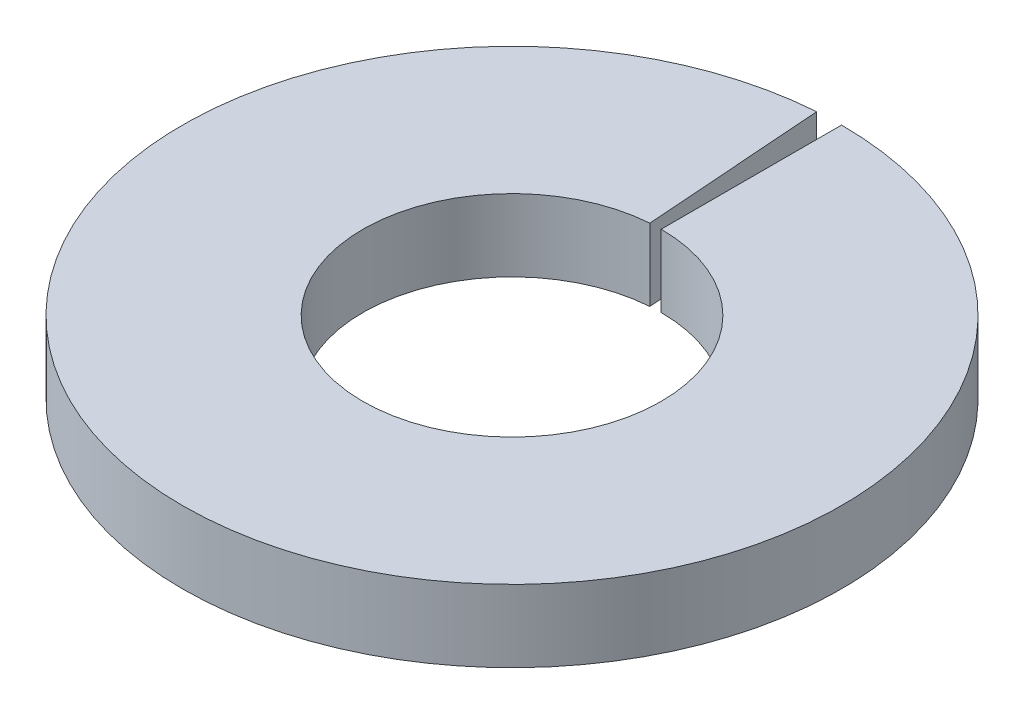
ISO-10303-21;
HEADER;
FILE_DESCRIPTION(('STEP AP214'),'2;1');
FILE_NAME('part.step','',(''),(''),'','','');
FILE_SCHEMA(('AUTOMOTIVE_DESIGN { 1 0 10303 214 1 1 1 1 }'));
ENDSEC;
DATA;
#1=APPLICATION_CONTEXT('core data for automotive mechanical design processes');
#2=APPLICATION_PROTOCOL_DEFINITION('international standard','automotive_design',2000,#1);
#3=PRODUCT_CONTEXT('',#1,'mechanical');
#4=PRODUCT('Part','Part','',(#3));
#5=PRODUCT_RELATED_PRODUCT_CATEGORY('part','',(#4));
#6=PRODUCT_DEFINITION_FORMATION('','',#4);
#7=PRODUCT_DEFINITION_CONTEXT('part definition',#1,'design');
#8=PRODUCT_DEFINITION('design','',#6,#7);
#9=PRODUCT_DEFINITION_SHAPE('','',#8);
#10=(LENGTH_UNIT() NAMED_UNIT(*) SI_UNIT(.MILLI.,.METRE.));
#11=(NAMED_UNIT(*) PLANE_ANGLE_UNIT() SI_UNIT($,.RADIAN.));
#12=(NAMED_UNIT(*) SI_UNIT($,.STERADIAN.) SOLID_ANGLE_UNIT());
#13=UNCERTAINTY_MEASURE_WITH_UNIT(LENGTH_MEASURE(1.E-05),#10,'distance_accuracy_value','');
#14=(GEOMETRIC_REPRESENTATION_CONTEXT(3) GLOBAL_UNCERTAINTY_ASSIGNED_CONTEXT((#13)) GLOBAL_UNIT_ASSIGNED_CONTEXT((#10,
#11,#12)) REPRESENTATION_CONTEXT('',''));
#15=CARTESIAN_POINT('',(0.,0.,0.));
#16=DIRECTION('',(0.,0.,1.));
#17=DIRECTION('',(1.,0.,0.));
#18=AXIS2_PLACEMENT_3D('',#15,#16,#17);
#19=CARTESIAN_POINT('',(0.,0.381,0.));
#20=DIRECTION('',(0.,-1.,0.));
#21=DIRECTION('',(0.,0.,-1.));
#22=AXIS2_PLACEMENT_3D('',#19,#20,#21);
#23=CYLINDRICAL_SURFACE('',#22,0.7874);
#24=CARTESIAN_POINT('',(0.,0.,0.));
#25=DIRECTION('',(0.,-1.,0.));
#26=DIRECTION('',(0.,0.,1.));
#27=AXIS2_PLACEMENT_3D('',#24,#25,#26);
#28=CIRCLE('',#27,0.7874);
#29=CARTESIAN_POINT('',(0.,0.,-0.7874));
#30=VERTEX_POINT('',#29);
#31=CARTESIAN_POINT('',(-0.0574744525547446,0.,-0.78529959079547));
#32=VERTEX_POINT('',#31);
#33=EDGE_CURVE('E97',#30,#32,#28,.T.);
#34=ORIENTED_EDGE('',*,*,#33,.T.);
#35=DIRECTION('',(0.,-1.,0.));
#36=VECTOR('',#35,1.);
#37=CARTESIAN_POINT('',(-0.0574744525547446,0.381,-0.78529959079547));
#38=LINE('',#37,#36);
#39=CARTESIAN_POINT('',(-0.0574744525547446,0.381,-0.78529959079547));
#40=VERTEX_POINT('',#39);
#41=EDGE_CURVE('E11',#40,#32,#38,.T.);
#42=ORIENTED_EDGE('',*,*,#41,.F.);
#43=CARTESIAN_POINT('',(0.,0.381,0.));
#44=DIRECTION('',(0.,-1.,0.));
#45=DIRECTION('',(0.,0.,1.));
#46=AXIS2_PLACEMENT_3D('',#43,#44,#45);
#47=CIRCLE('',#46,0.7874);
#48=CARTESIAN_POINT('',(0.,0.381,-0.7874));
#49=VERTEX_POINT('',#48);
#50=EDGE_CURVE('E85',#49,#40,#47,.T.);
#51=ORIENTED_EDGE('',*,*,#50,.F.);
#52=DIRECTION('',(0.,-1.,0.));
#53=VECTOR('',#52,1.);
#54=CARTESIAN_POINT('',(0.,0.381,-0.7874));
#55=LINE('',#54,#53);
#56=EDGE_CURVE('E93',#49,#30,#55,.T.);
#57=ORIENTED_EDGE('',*,*,#56,.T.);
#58=EDGE_LOOP('',(#34,#42,#51,#57));
#59=FACE_BOUND('',#58,.T.);
#60=ADVANCED_FACE('F34',(#59),#23,.F.);
#61=CARTESIAN_POINT('',(-0.0574744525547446,0.381,-0.78529959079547));
#62=DIRECTION('',(-0.997332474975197,0.,0.072992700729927));
#63=DIRECTION('',(0.072992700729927,0.,0.997332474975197));
#64=AXIS2_PLACEMENT_3D('',#61,#62,#63);
#65=PLANE('',#64);
#66=DIRECTION('',(-0.072992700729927,0.,-0.997332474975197));
#67=VECTOR('',#66,1.);
#68=CARTESIAN_POINT('',(-0.0574744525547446,0.,-0.78529959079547));
#69=LINE('',#68,#67);
#70=CARTESIAN_POINT('',(-0.127,0.,-1.73525877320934));
#71=VERTEX_POINT('',#70);
#72=EDGE_CURVE('E89',#32,#71,#69,.T.);
#73=ORIENTED_EDGE('',*,*,#72,.T.);
#74=DIRECTION('',(0.,-1.,0.));
#75=VECTOR('',#74,1.);
#76=CARTESIAN_POINT('',(-0.127,0.381,-1.73525877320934));
#77=LINE('',#76,#75);
#78=CARTESIAN_POINT('',(-0.127,0.381,-1.73525877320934));
#79=VERTEX_POINT('',#78);
#80=EDGE_CURVE('E42',#79,#71,#77,.T.);
#81=ORIENTED_EDGE('',*,*,#80,.F.);
#82=DIRECTION('',(-0.072992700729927,0.,-0.997332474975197));
#83=VECTOR('',#82,1.);
#84=CARTESIAN_POINT('',(-0.0574744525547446,0.381,-0.78529959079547));
#85=LINE('',#84,#83);
#86=EDGE_CURVE('E80',#40,#79,#85,.T.);
#87=ORIENTED_EDGE('',*,*,#86,.F.);
#88=ORIENTED_EDGE('',*,*,#41,.T.);
#89=EDGE_LOOP('',(#73,#81,#87,#88));
#90=FACE_BOUND('',#89,.T.);
#91=ADVANCED_FACE('F88',(#90),#65,.F.);
#92=CARTESIAN_POINT('',(0.,0.381,0.));
#93=DIRECTION('',(0.,-1.,0.));
#94=DIRECTION('',(0.,0.,-1.));
#95=AXIS2_PLACEMENT_3D('',#92,#93,#94);
#96=CYLINDRICAL_SURFACE('',#95,1.7399);
#97=CARTESIAN_POINT('',(0.,0.,0.));
#98=DIRECTION('',(0.,1.,0.));
#99=DIRECTION('',(0.,0.,1.));
#100=AXIS2_PLACEMENT_3D('',#97,#98,#99);
#101=CIRCLE('',#100,1.7399);
#102=CARTESIAN_POINT('',(0.,0.,-1.7399));
#103=VERTEX_POINT('',#102);
#104=EDGE_CURVE('E67',#71,#103,#101,.T.);
#105=ORIENTED_EDGE('',*,*,#104,.T.);
#106=DIRECTION('',(0.,-1.,0.));
#107=VECTOR('',#106,1.);
#108=CARTESIAN_POINT('',(0.,0.381,-1.7399));
#109=LINE('',#108,#107);
#110=CARTESIAN_POINT('',(0.,0.381,-1.7399));
#111=VERTEX_POINT('',#110);
#112=EDGE_CURVE('E90',#111,#103,#109,.T.);
#113=ORIENTED_EDGE('',*,*,#112,.F.);
#114=CARTESIAN_POINT('',(0.,0.381,0.));
#115=DIRECTION('',(0.,1.,0.));
#116=DIRECTION('',(0.,0.,1.));
#117=AXIS2_PLACEMENT_3D('',#114,#115,#116);
#118=CIRCLE('',#117,1.7399);
#119=EDGE_CURVE('E83',#79,#111,#118,.T.);
#120=ORIENTED_EDGE('',*,*,#119,.F.);
#121=ORIENTED_EDGE('',*,*,#80,.T.);
#122=EDGE_LOOP('',(#105,#113,#120,#121));
#123=FACE_BOUND('',#122,.T.);
#124=ADVANCED_FACE('F91',(#123),#96,.T.);
#125=CARTESIAN_POINT('',(0.,0.381,-0.7874));
#126=DIRECTION('',(1.,0.,0.));
#127=DIRECTION('',(0.,0.,-1.));
#128=AXIS2_PLACEMENT_3D('',#125,#126,#127);
#129=PLANE('',#128);
#130=DIRECTION('',(0.,0.,1.));
#131=VECTOR('',#130,1.);
#132=CARTESIAN_POINT('',(0.,0.,-0.7874));
#133=LINE('',#132,#131);
#134=EDGE_CURVE('E73',#103,#30,#133,.T.);
#135=ORIENTED_EDGE('',*,*,#134,.T.);
#136=ORIENTED_EDGE('',*,*,#56,.F.);
#137=DIRECTION('',(0.,0.,1.));
#138=VECTOR('',#137,1.);
#139=CARTESIAN_POINT('',(0.,0.381,-0.7874));
#140=LINE('',#139,#138);
#141=EDGE_CURVE('E50',#111,#49,#140,.T.);
#142=ORIENTED_EDGE('',*,*,#141,.F.);
#143=ORIENTED_EDGE('',*,*,#112,.T.);
#144=EDGE_LOOP('',(#135,#136,#142,#143));
#145=FACE_BOUND('',#144,.T.);
#146=ADVANCED_FACE('F104',(#145),#129,.F.);
#147=CARTESIAN_POINT('',(0.,0.381,0.));
#148=DIRECTION('',(0.,1.,0.));
#149=DIRECTION('',(0.,0.,1.));
#150=AXIS2_PLACEMENT_3D('',#147,#148,#149);
#151=PLANE('',#150);
#152=ORIENTED_EDGE('',*,*,#50,.T.);
#153=ORIENTED_EDGE('',*,*,#86,.T.);
#154=ORIENTED_EDGE('',*,*,#119,.T.);
#155=ORIENTED_EDGE('',*,*,#141,.T.);
#156=EDGE_LOOP('',(#152,#153,#154,#155));
#157=FACE_BOUND('',#156,.T.);
#158=ADVANCED_FACE('F81',(#157),#151,.T.);
#159=CARTESIAN_POINT('',(0.,0.,0.));
#160=DIRECTION('',(0.,1.,0.));
#161=DIRECTION('',(0.,0.,1.));
#162=AXIS2_PLACEMENT_3D('',#159,#160,#161);
#163=PLANE('',#162);
#164=ORIENTED_EDGE('',*,*,#33,.F.);
#165=ORIENTED_EDGE('',*,*,#134,.F.);
#166=ORIENTED_EDGE('',*,*,#104,.F.);
#167=ORIENTED_EDGE('',*,*,#72,.F.);
#168=EDGE_LOOP('',(#164,#165,#166,#167));
#169=FACE_BOUND('',#168,.T.);
#170=ADVANCED_FACE('F107',(#169),#163,.F.);
#171=CLOSED_SHELL('',(#60,#91,#124,#146,#158,#170));
#172=MANIFOLD_SOLID_BREP('B2',#171);
#173=ADVANCED_BREP_SHAPE_REPRESENTATION('',(#18,#172),#14);
#174=SHAPE_DEFINITION_REPRESENTATION(#9,#173);
ENDSEC;
END-ISO-10303-21;
